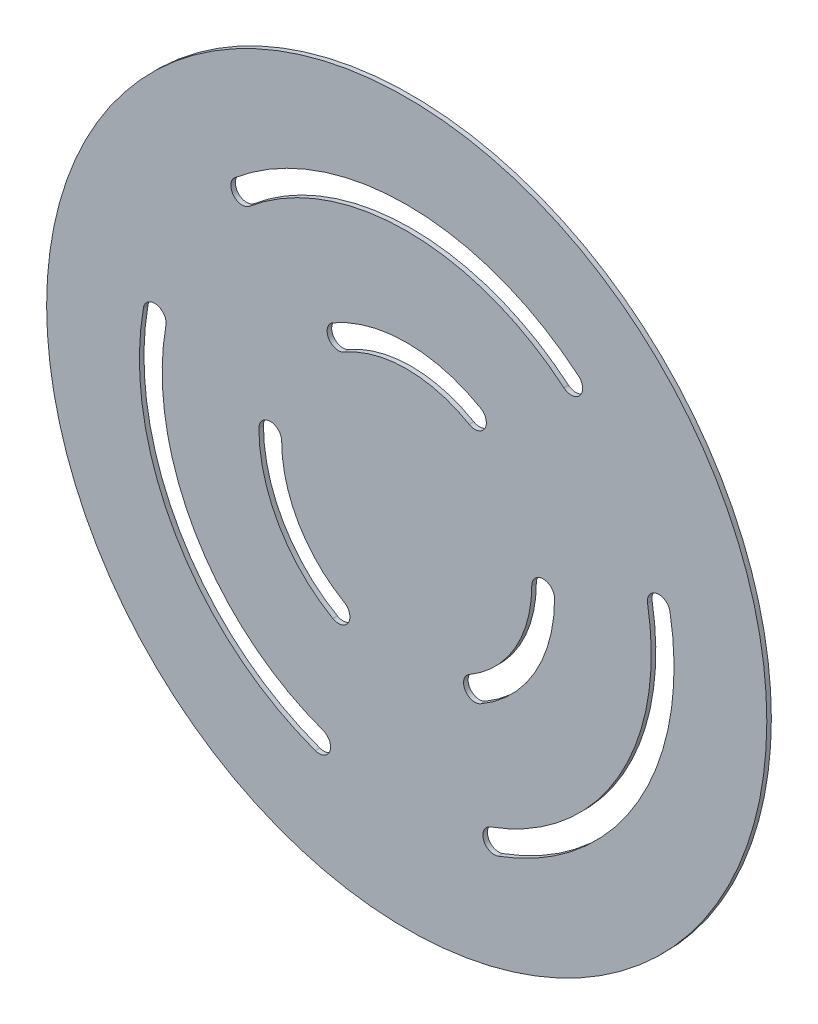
from build123d import *

# Parameters (mm, degrees)
SKETCH1_R           = 158
BOSS_EXTRUDE1_DEPTH = 2
CUT_EXTRUDE1_DEPTH  = 10
CIRPATTERN1_COUNT   = 3


with BuildPart() as part:
    # Sketch1 → Boss-Extrude1 (new body)
    with BuildSketch(Plane.XY):
        Circle(SKETCH1_R)
    extrude(amount=BOSS_EXTRUDE1_DEPTH)

    # Sketch2 → Cut-Extrude1 (cut)
    with BuildSketch(Plane.XY.offset(2)):
        with BuildLine():
            ThreePointArc((32.435644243, 56.180183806), (0, 64.871288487), (-32.435644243, 56.180183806))
            ThreePointArc((-32.435644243, 56.180183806), (-34.265771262, 49.350056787), (-27.435644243, 47.519929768))
            ThreePointArc((-27.435644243, 47.519929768), (0, 54.871288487), (27.435644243, 47.519929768))
            ThreePointArc((27.435644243, 47.519929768), (34.265771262, 49.350056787), (32.435644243, 56.180183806))
        make_face()
        with BuildLine():
            ThreePointArc((75.395338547, 89.852665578), (0, 117.294324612), (-75.395338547, 89.852665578))
            ThreePointArc((-75.395338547, 89.852665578), (-76.011622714, 82.808505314), (-68.96746245, 82.192221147))
            ThreePointArc((-68.96746245, 82.192221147), (0, 107.294324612), (68.96746245, 82.192221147))
            ThreePointArc((68.96746245, 82.192221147), (76.011622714, 82.808505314), (75.395338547, 89.852665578))
        make_face()
    cut_extrude1 = extrude(amount=-CUT_EXTRUDE1_DEPTH, mode=Mode.SUBTRACT)

    # CirPattern1: Cut-Extrude1 ×3 about axis
    cirpattern1_axis = Axis((0, 0, 0), (0, 0, 1))
    for i in range(1, CIRPATTERN1_COUNT):
        add(cut_extrude1.rotate(cirpattern1_axis, i * 360 / CIRPATTERN1_COUNT), mode=Mode.SUBTRACT)


solid = part.part
